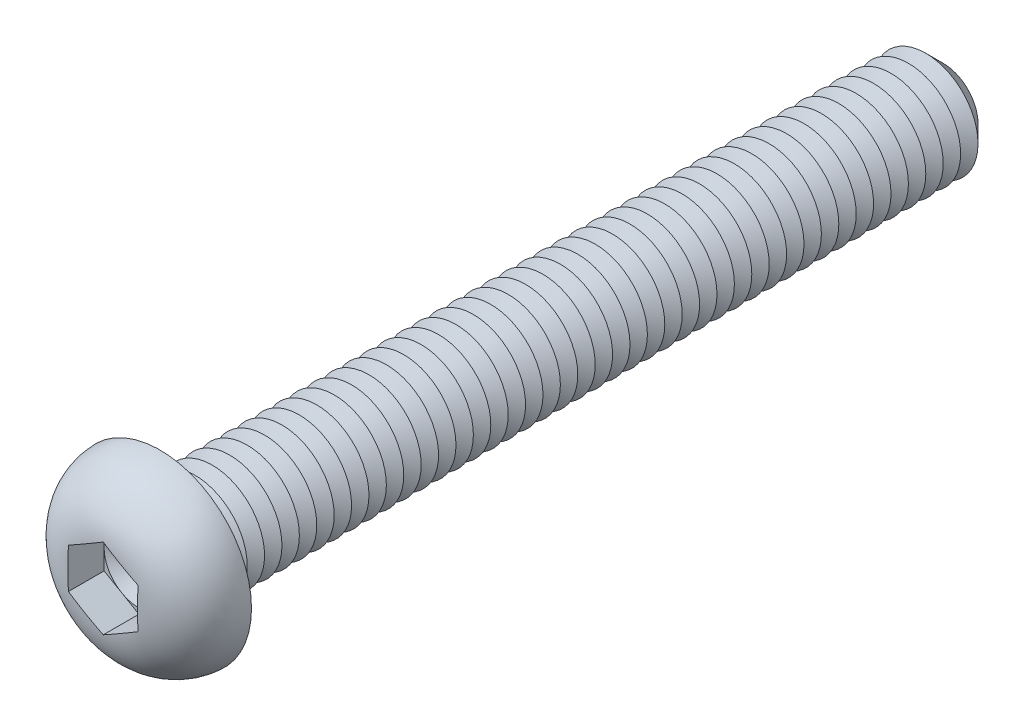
from build123d import *

# Parameters (mm, degrees)
CUT_EXTRUDE1_DEPTH  = 2.08
SKETCH4_R           = 3
BOSS_EXTRUDE1_DEPTH = 45
CHAMFER1_SIZE       = 1
LPATTERN1_COUNT     = 43
LPATTERN1_PITCH     = 1
FILLET2_R           = 0.5


with BuildPart() as part:
    # Sketch2 → Revolve1 (revolve)
    with BuildSketch(Plane(origin=(0, 0, 0), x_dir=(0, 0, -1), z_dir=(1, 0, 0)), mode=Mode.PRIVATE) as revolve1_sk:
        with BuildLine():
            Line((0, 0), (-3.3, 0))
            Line((-3.3, 0), (-3.3, 1.851470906))
            ThreePointArc((-3.3, 1.851470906), (-2.339262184, 4.220014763), (0, 5.25))
            Line((0, 5.25), (0, 0))
        make_face()
    revolve(revolve1_sk.sketch.rotate(Axis((0, 0, 47.934239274), (0, 0, -1)), 90), axis=Axis((0, 0, 47.934239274), (0, 0, -1)))

    # Sketch3 → Cut-Extrude1 (cut)
    with BuildSketch(Plane.XY.offset(3.3)):
        Polygon((0, 2.309401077), (-2, 1.154700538), (-2, -1.154700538), (0, -2.309401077), (2, -1.154700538), (2, 1.154700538), align=None)
    extrude(amount=-CUT_EXTRUDE1_DEPTH, mode=Mode.SUBTRACT)

    # Sketch4 → Boss-Extrude1 (add)
    with BuildSketch(Plane(origin=(0, 0, 0), x_dir=(-1, 0, 0), z_dir=(0, 0, -1))):
        with Locations(Location((0, 0, 0), (0, 0, 180))):
            Circle(SKETCH4_R)
    extrude(amount=BOSS_EXTRUDE1_DEPTH)

    # Chamfer1
    chamfer1_edges = [part.edges().sort_by_distance(p)[0] for p in [
        (-3, 0, -45),
    ]]
    chamfer(chamfer1_edges, length=CHAMFER1_SIZE)

    # Sketch5 → Cut-Revolve1 (revolve, cut)
    with BuildSketch(Plane(origin=(0, 0, 0), x_dir=(0, 0, -1), z_dir=(1, 0, 0)), mode=Mode.PRIVATE) as cut_revolve1_sk:
        Polygon((1, 3), (2, 3), (1.5, 2.133974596), align=None)
    cut_revolve1 = revolve(cut_revolve1_sk.sketch.rotate(Axis((0, 0, 47.934239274), (0, 0, -1)), 90), axis=Axis((0, 0, 47.934239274), (0, 0, -1)), mode=Mode.SUBTRACT)

    # LPattern1: Cut-Revolve1 ×43
    with Locations(*[(0, 0, -i * LPATTERN1_PITCH) for i in range(1, LPATTERN1_COUNT)]):
        add(cut_revolve1, mode=Mode.SUBTRACT)

    # Fillet2
    fillet2_edges = [part.edges().sort_by_distance(p)[0] for p in [
        (-3, 0, 0),
    ]]
    fillet(fillet2_edges, radius=FILLET2_R)

    # Cut-Extrude2 cone 1 section (on through the dimple's axis) → Cut-Extrude2 (revolve, cut)
    with BuildSketch(Plane(origin=(0, 0, 1.22), x_dir=(0, -1, 0), z_dir=(1, 0, 0))):
        Polygon((0, 0), (2, 0), (0, 1.154700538), align=None)
    revolve(axis=Axis((0, 0, 1.22), (0, 0, -1)), mode=Mode.SUBTRACT)


solid = part.part
